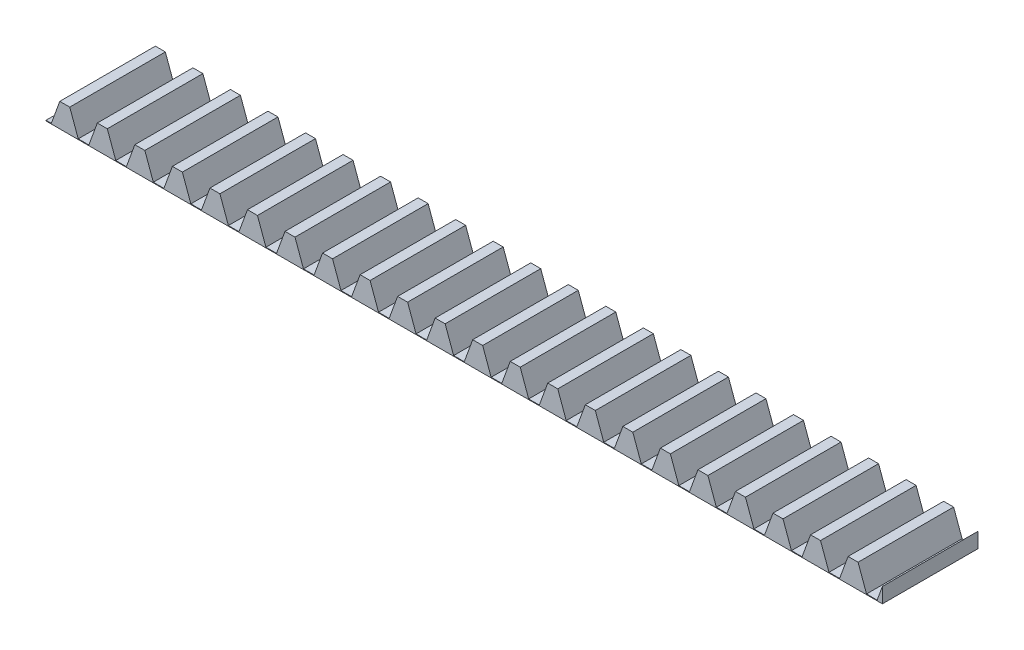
from build123d import *

# Parameters (mm, degrees)
BLANKSKE_W        = 70
BLANKSKE_H        = 2
BLANK_DEPTH       = 8
TOOTHCUTSIM_DEPTH = 71.484040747
TEETHCUTS_COUNT   = 23
TEETHCUTS_PITCH   = 3.14159265


with BuildPart() as part:
    # BlankSke → Blank (new body)
    with BuildSketch(Plane.XY):
        with Locations((35, 1)):
            Rectangle(BLANKSKE_W, BLANKSKE_H)
    extrude(amount=-BLANK_DEPTH)

    # TooCutSkeSim → ToothCutSim (cut, through all)
    with BuildSketch(Plane.XY):
        Polygon((0.44443537, 0.0528), (-0.44443537, 0.0528), (-1.272613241, 2.3282), (1.272613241, 2.3282), align=None)
    toothcutsim = extrude(amount=-TOOTHCUTSIM_DEPTH, mode=Mode.SUBTRACT)

    # TeethCuts: ToothCutSim ×23
    with Locations(*[(i * TEETHCUTS_PITCH, 0, 0) for i in range(1, TEETHCUTS_COUNT)]):
        add(toothcutsim, mode=Mode.SUBTRACT)


solid = part.part
